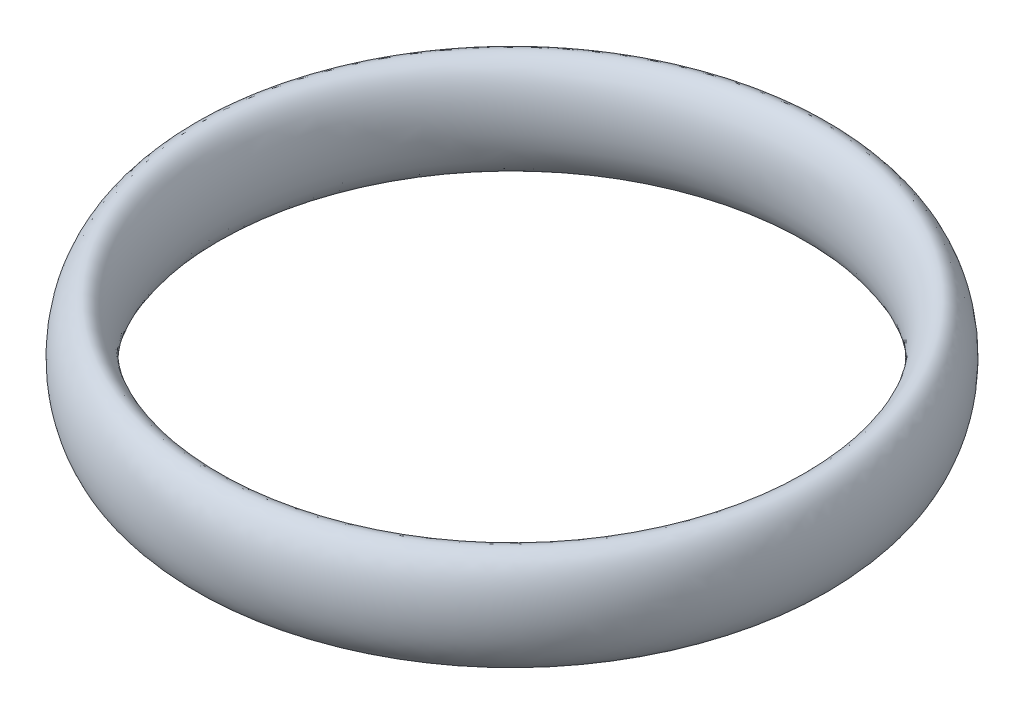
from build123d import *

# Parameters (mm, degrees)
SKETCH1_RX = 1.27
SKETCH1_RY = 0.635


with BuildPart() as part:
    # Sketch1 → Body (revolve)
    with BuildSketch(Plane.XY):
        with Locations(Location((7.5692, 1.27), (0, 0, 90))):
            Ellipse(SKETCH1_RX, SKETCH1_RY)
    revolve(axis=Axis((0, 0, 0), (0, 1, 0)))


solid = part.part
